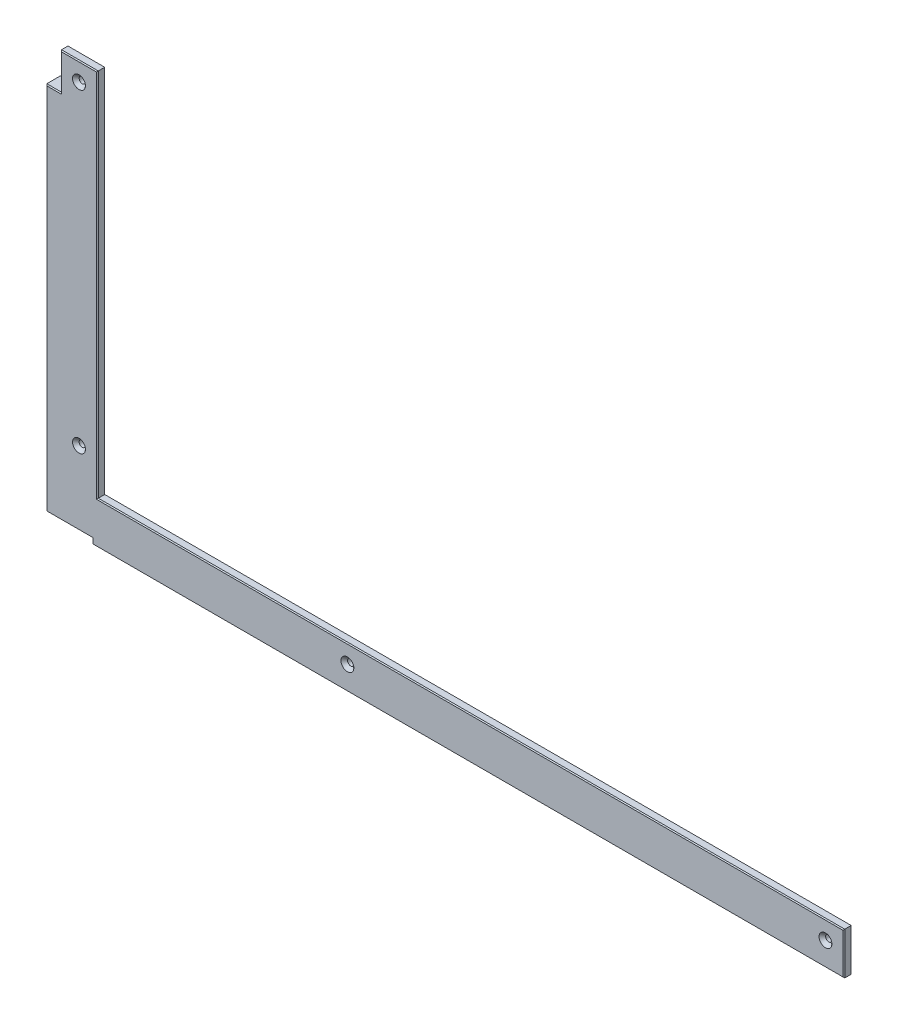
ISO-10303-21;
HEADER;
FILE_DESCRIPTION(('STEP AP214'),'2;1');
FILE_NAME('part.step','',(''),(''),'','','');
FILE_SCHEMA(('AUTOMOTIVE_DESIGN { 1 0 10303 214 1 1 1 1 }'));
ENDSEC;
DATA;
#1=APPLICATION_CONTEXT('core data for automotive mechanical design processes');
#2=APPLICATION_PROTOCOL_DEFINITION('international standard','automotive_design',2000,#1);
#3=PRODUCT_CONTEXT('',#1,'mechanical');
#4=PRODUCT('Part','Part','',(#3));
#5=PRODUCT_RELATED_PRODUCT_CATEGORY('part','',(#4));
#6=PRODUCT_DEFINITION_FORMATION('','',#4);
#7=PRODUCT_DEFINITION_CONTEXT('part definition',#1,'design');
#8=PRODUCT_DEFINITION('design','',#6,#7);
#9=PRODUCT_DEFINITION_SHAPE('','',#8);
#10=(LENGTH_UNIT() NAMED_UNIT(*) SI_UNIT(.MILLI.,.METRE.));
#11=(NAMED_UNIT(*) PLANE_ANGLE_UNIT() SI_UNIT($,.RADIAN.));
#12=(NAMED_UNIT(*) SI_UNIT($,.STERADIAN.) SOLID_ANGLE_UNIT());
#13=UNCERTAINTY_MEASURE_WITH_UNIT(LENGTH_MEASURE(1.E-05),#10,'distance_accuracy_value','');
#14=(GEOMETRIC_REPRESENTATION_CONTEXT(3) GLOBAL_UNCERTAINTY_ASSIGNED_CONTEXT((#13)) GLOBAL_UNIT_ASSIGNED_CONTEXT((#10,
#11,#12)) REPRESENTATION_CONTEXT('',''));
#15=CARTESIAN_POINT('',(0.,0.,0.));
#16=DIRECTION('',(0.,0.,1.));
#17=DIRECTION('',(1.,0.,0.));
#18=AXIS2_PLACEMENT_3D('',#15,#16,#17);
#19=CARTESIAN_POINT('',(-416.,-211.25,8.));
#20=DIRECTION('',(0.,1.,0.));
#21=DIRECTION('',(0.,0.,1.));
#22=AXIS2_PLACEMENT_3D('',#19,#20,#21);
#23=PLANE('',#22);
#24=DIRECTION('',(0.,0.,-1.));
#25=VECTOR('',#24,1.);
#26=CARTESIAN_POINT('',(-399.,-211.25,8.));
#27=LINE('',#26,#25);
#28=CARTESIAN_POINT('',(-399.,-211.25,7.50000000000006));
#29=VERTEX_POINT('',#28);
#30=CARTESIAN_POINT('',(-399.,-211.25,0.));
#31=VERTEX_POINT('',#30);
#32=EDGE_CURVE('E239',#29,#31,#27,.T.);
#33=ORIENTED_EDGE('',*,*,#32,.F.);
#34=DIRECTION('',(-1.,0.,0.));
#35=VECTOR('',#34,1.);
#36=CARTESIAN_POINT('',(-416.,-211.25,7.50000000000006));
#37=LINE('',#36,#35);
#38=CARTESIAN_POINT('',(-424.,-211.25,7.50000000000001));
#39=VERTEX_POINT('',#38);
#40=EDGE_CURVE('E397',#29,#39,#37,.T.);
#41=ORIENTED_EDGE('',*,*,#40,.T.);
#42=DIRECTION('',(0.,0.,1.));
#43=VECTOR('',#42,1.);
#44=CARTESIAN_POINT('',(-424.,-211.25,-201.451141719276));
#45=LINE('',#44,#43);
#46=CARTESIAN_POINT('',(-424.,-211.25,0.));
#47=VERTEX_POINT('',#46);
#48=EDGE_CURVE('E248',#47,#39,#45,.T.);
#49=ORIENTED_EDGE('',*,*,#48,.F.);
#50=DIRECTION('',(1.,0.,0.));
#51=VECTOR('',#50,1.);
#52=CARTESIAN_POINT('',(-416.,-211.25,0.));
#53=LINE('',#52,#51);
#54=EDGE_CURVE('E328',#47,#31,#53,.T.);
#55=ORIENTED_EDGE('',*,*,#54,.T.);
#56=EDGE_LOOP('',(#33,#41,#49,#55));
#57=FACE_BOUND('',#56,.T.);
#58=ADVANCED_FACE('F38',(#57),#23,.F.);
#59=CARTESIAN_POINT('',(0.,0.,8.));
#60=DIRECTION('',(0.,0.,-1.));
#61=DIRECTION('',(-1.,0.,0.));
#62=AXIS2_PLACEMENT_3D('',#59,#60,#61);
#63=PLANE('',#62);
#64=DIRECTION('',(1.,0.,0.));
#65=VECTOR('',#64,1.);
#66=CARTESIAN_POINT('',(0.,-213.75,8.));
#67=LINE('',#66,#65);
#68=CARTESIAN_POINT('',(-398.5,-213.75,8.));
#69=VERTEX_POINT('',#68);
#70=CARTESIAN_POINT('',(9.50000000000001,-213.75,8.));
#71=VERTEX_POINT('',#70);
#72=EDGE_CURVE('E358',#69,#71,#67,.T.);
#73=ORIENTED_EDGE('',*,*,#72,.T.);
#74=DIRECTION('',(0.,1.,0.));
#75=VECTOR('',#74,1.);
#76=CARTESIAN_POINT('',(9.50000000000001,0.,8.));
#77=LINE('',#76,#75);
#78=CARTESIAN_POINT('',(9.50000000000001,-191.75,8.));
#79=VERTEX_POINT('',#78);
#80=EDGE_CURVE('E378',#71,#79,#77,.T.);
#81=ORIENTED_EDGE('',*,*,#80,.T.);
#82=DIRECTION('',(-1.,0.,0.));
#83=VECTOR('',#82,1.);
#84=CARTESIAN_POINT('',(-396.,-191.75,8.));
#85=LINE('',#84,#83);
#86=CARTESIAN_POINT('',(-396.5,-191.75,8.));
#87=VERTEX_POINT('',#86);
#88=EDGE_CURVE('E375',#79,#87,#85,.T.);
#89=ORIENTED_EDGE('',*,*,#88,.T.);
#90=DIRECTION('',(0.,1.,0.));
#91=VECTOR('',#90,1.);
#92=CARTESIAN_POINT('',(-396.5,10.,8.));
#93=LINE('',#92,#91);
#94=CARTESIAN_POINT('',(-396.5,9.50000000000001,8.));
#95=VERTEX_POINT('',#94);
#96=EDGE_CURVE('E373',#87,#95,#93,.T.);
#97=ORIENTED_EDGE('',*,*,#96,.T.);
#98=DIRECTION('',(-1.,0.,0.));
#99=VECTOR('',#98,1.);
#100=CARTESIAN_POINT('',(0.,9.50000000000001,8.));
#101=LINE('',#100,#99);
#102=CARTESIAN_POINT('',(-415.5,9.50000000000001,8.));
#103=VERTEX_POINT('',#102);
#104=EDGE_CURVE('E371',#95,#103,#101,.T.);
#105=ORIENTED_EDGE('',*,*,#104,.T.);
#106=DIRECTION('',(0.,-1.,0.));
#107=VECTOR('',#106,1.);
#108=CARTESIAN_POINT('',(-415.5,0.,8.));
#109=LINE('',#108,#107);
#110=CARTESIAN_POINT('',(-415.5,-10.5,8.));
#111=VERTEX_POINT('',#110);
#112=EDGE_CURVE('E369',#103,#111,#109,.T.);
#113=ORIENTED_EDGE('',*,*,#112,.T.);
#114=DIRECTION('',(-1.,0.,0.));
#115=VECTOR('',#114,1.);
#116=CARTESIAN_POINT('',(0.,-10.5,8.));
#117=LINE('',#116,#115);
#118=CARTESIAN_POINT('',(-423.5,-10.5,8.));
#119=VERTEX_POINT('',#118);
#120=EDGE_CURVE('E367',#111,#119,#117,.T.);
#121=ORIENTED_EDGE('',*,*,#120,.T.);
#122=DIRECTION('',(0.,-1.,0.));
#123=VECTOR('',#122,1.);
#124=CARTESIAN_POINT('',(-423.5,-211.25,8.));
#125=LINE('',#124,#123);
#126=CARTESIAN_POINT('',(-423.5,-210.75,8.));
#127=VERTEX_POINT('',#126);
#128=EDGE_CURVE('E365',#119,#127,#125,.T.);
#129=ORIENTED_EDGE('',*,*,#128,.T.);
#130=DIRECTION('',(1.,0.,0.));
#131=VECTOR('',#130,1.);
#132=CARTESIAN_POINT('',(0.,-210.75,8.));
#133=LINE('',#132,#131);
#134=CARTESIAN_POINT('',(-398.5,-210.75,8.));
#135=VERTEX_POINT('',#134);
#136=EDGE_CURVE('E363',#127,#135,#133,.T.);
#137=ORIENTED_EDGE('',*,*,#136,.T.);
#138=DIRECTION('',(0.,-1.,0.));
#139=VECTOR('',#138,1.);
#140=CARTESIAN_POINT('',(-398.5,0.,8.));
#141=LINE('',#140,#139);
#142=EDGE_CURVE('E361',#135,#69,#141,.T.);
#143=ORIENTED_EDGE('',*,*,#142,.T.);
#144=EDGE_LOOP('',(#73,#81,#89,#97,#105,#113,#121,#129,#137,#143));
#145=FACE_BOUND('',#144,.T.);
#146=CARTESIAN_POINT('',(0.,-201.25,8.));
#147=DIRECTION('',(0.,0.,1.));
#148=DIRECTION('',(1.,0.,0.));
#149=AXIS2_PLACEMENT_3D('',#146,#147,#148);
#150=CIRCLE('',#149,3.5);
#151=CARTESIAN_POINT('',(3.5,-201.25,8.));
#152=VERTEX_POINT('',#151);
#153=EDGE_CURVE('E301',#152,#152,#150,.T.);
#154=ORIENTED_EDGE('',*,*,#153,.F.);
#155=EDGE_LOOP('',(#154));
#156=FACE_BOUND('',#155,.T.);
#157=CARTESIAN_POINT('',(-406.,0.,8.));
#158=DIRECTION('',(0.,0.,1.));
#159=DIRECTION('',(1.,0.,0.));
#160=AXIS2_PLACEMENT_3D('',#157,#158,#159);
#161=CIRCLE('',#160,3.5);
#162=CARTESIAN_POINT('',(-402.5,0.,8.));
#163=VERTEX_POINT('',#162);
#164=EDGE_CURVE('E294',#163,#163,#161,.T.);
#165=ORIENTED_EDGE('',*,*,#164,.F.);
#166=EDGE_LOOP('',(#165));
#167=FACE_BOUND('',#166,.T.);
#168=CARTESIAN_POINT('',(-406.,-171.25,8.));
#169=DIRECTION('',(0.,0.,1.));
#170=DIRECTION('',(1.,0.,0.));
#171=AXIS2_PLACEMENT_3D('',#168,#169,#170);
#172=CIRCLE('',#171,3.5);
#173=CARTESIAN_POINT('',(-402.5,-171.25,8.));
#174=VERTEX_POINT('',#173);
#175=EDGE_CURVE('E287',#174,#174,#172,.T.);
#176=ORIENTED_EDGE('',*,*,#175,.F.);
#177=EDGE_LOOP('',(#176));
#178=FACE_BOUND('',#177,.T.);
#179=CARTESIAN_POINT('',(-260.,-201.25,8.));
#180=DIRECTION('',(0.,0.,1.));
#181=DIRECTION('',(1.,0.,0.));
#182=AXIS2_PLACEMENT_3D('',#179,#180,#181);
#183=CIRCLE('',#182,3.5);
#184=CARTESIAN_POINT('',(-256.5,-201.25,8.));
#185=VERTEX_POINT('',#184);
#186=EDGE_CURVE('E280',#185,#185,#183,.T.);
#187=ORIENTED_EDGE('',*,*,#186,.F.);
#188=EDGE_LOOP('',(#187));
#189=FACE_BOUND('',#188,.T.);
#190=ADVANCED_FACE('F486',(#145,#156,#167,#178,#189),#63,.F.);
#191=CARTESIAN_POINT('',(0.,0.,0.));
#192=DIRECTION('',(0.,0.,-1.));
#193=DIRECTION('',(-1.,0.,0.));
#194=AXIS2_PLACEMENT_3D('',#191,#192,#193);
#195=PLANE('',#194);
#196=DIRECTION('',(0.,1.,0.));
#197=VECTOR('',#196,1.);
#198=CARTESIAN_POINT('',(-10.,-211.25,0.));
#199=LINE('',#198,#197);
#200=CARTESIAN_POINT('',(-10.,-211.25,0.));
#201=VERTEX_POINT('',#200);
#202=CARTESIAN_POINT('',(-9.9999999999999,-203.75,0.));
#203=VERTEX_POINT('',#202);
#204=EDGE_CURVE('E251',#201,#203,#199,.T.);
#205=ORIENTED_EDGE('',*,*,#204,.F.);
#206=DIRECTION('',(-1.,0.,0.));
#207=VECTOR('',#206,1.);
#208=CARTESIAN_POINT('',(-399.,-211.25,0.));
#209=LINE('',#208,#207);
#210=EDGE_CURVE('E414',#201,#31,#209,.T.);
#211=ORIENTED_EDGE('',*,*,#210,.T.);
#212=ORIENTED_EDGE('',*,*,#54,.F.);
#213=DIRECTION('',(0.,-1.,0.));
#214=VECTOR('',#213,1.);
#215=CARTESIAN_POINT('',(-424.,-9.99999999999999,0.));
#216=LINE('',#215,#214);
#217=CARTESIAN_POINT('',(-424.,-9.99999999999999,0.));
#218=VERTEX_POINT('',#217);
#219=EDGE_CURVE('E245',#218,#47,#216,.T.);
#220=ORIENTED_EDGE('',*,*,#219,.F.);
#221=DIRECTION('',(1.,0.,0.));
#222=VECTOR('',#221,1.);
#223=CARTESIAN_POINT('',(-416.,-10.,0.));
#224=LINE('',#223,#222);
#225=CARTESIAN_POINT('',(-408.5,-10.,0.));
#226=VERTEX_POINT('',#225);
#227=EDGE_CURVE('E269',#218,#226,#224,.T.);
#228=ORIENTED_EDGE('',*,*,#227,.T.);
#229=DIRECTION('',(0.,1.,0.));
#230=VECTOR('',#229,1.);
#231=CARTESIAN_POINT('',(-408.5,203.75,0.));
#232=LINE('',#231,#230);
#233=CARTESIAN_POINT('',(-408.5,-203.75,0.));
#234=VERTEX_POINT('',#233);
#235=EDGE_CURVE('E312',#234,#226,#232,.T.);
#236=ORIENTED_EDGE('',*,*,#235,.F.);
#237=DIRECTION('',(-1.,0.,0.));
#238=VECTOR('',#237,1.);
#239=CARTESIAN_POINT('',(408.5,-203.75,0.));
#240=LINE('',#239,#238);
#241=EDGE_CURVE('E316',#203,#234,#240,.T.);
#242=ORIENTED_EDGE('',*,*,#241,.F.);
#243=EDGE_LOOP('',(#205,#211,#212,#220,#228,#236,#242));
#244=FACE_BOUND('',#243,.T.);
#245=ADVANCED_FACE('F458',(#244),#195,.T.);
#246=CARTESIAN_POINT('',(0.,0.,4.));
#247=DIRECTION('',(0.,0.,-1.));
#248=DIRECTION('',(-1.,0.,0.));
#249=AXIS2_PLACEMENT_3D('',#246,#247,#248);
#250=PLANE('',#249);
#251=DIRECTION('',(0.,1.,0.));
#252=VECTOR('',#251,1.);
#253=CARTESIAN_POINT('',(-396.,-191.25,4.));
#254=LINE('',#253,#252);
#255=CARTESIAN_POINT('',(-396.,-191.25,4.));
#256=VERTEX_POINT('',#255);
#257=CARTESIAN_POINT('',(-396.,10.,4.));
#258=VERTEX_POINT('',#257);
#259=EDGE_CURVE('E323',#256,#258,#254,.T.);
#260=ORIENTED_EDGE('',*,*,#259,.F.);
#261=DIRECTION('',(-1.,0.,0.));
#262=VECTOR('',#261,1.);
#263=CARTESIAN_POINT('',(-396.,-191.25,4.));
#264=LINE('',#263,#262);
#265=CARTESIAN_POINT('',(10.,-191.25,4.));
#266=VERTEX_POINT('',#265);
#267=EDGE_CURVE('E331',#266,#256,#264,.T.);
#268=ORIENTED_EDGE('',*,*,#267,.F.);
#269=DIRECTION('',(0.,1.,0.));
#270=VECTOR('',#269,1.);
#271=CARTESIAN_POINT('',(10.,-211.25,4.));
#272=LINE('',#271,#270);
#273=CARTESIAN_POINT('',(10.,-214.25,4.));
#274=VERTEX_POINT('',#273);
#275=EDGE_CURVE('E254',#274,#266,#272,.T.);
#276=ORIENTED_EDGE('',*,*,#275,.F.);
#277=DIRECTION('',(1.,0.,0.));
#278=VECTOR('',#277,1.);
#279=CARTESIAN_POINT('',(-10.,-214.25,4.));
#280=LINE('',#279,#278);
#281=CARTESIAN_POINT('',(-10.,-214.25,4.));
#282=VERTEX_POINT('',#281);
#283=EDGE_CURVE('E238',#282,#274,#280,.T.);
#284=ORIENTED_EDGE('',*,*,#283,.F.);
#285=DIRECTION('',(0.,1.,0.));
#286=VECTOR('',#285,1.);
#287=CARTESIAN_POINT('',(-10.,-211.25,4.));
#288=LINE('',#287,#286);
#289=CARTESIAN_POINT('',(-10.,-203.75,4.));
#290=VERTEX_POINT('',#289);
#291=EDGE_CURVE('E257',#282,#290,#288,.T.);
#292=ORIENTED_EDGE('',*,*,#291,.T.);
#293=DIRECTION('',(-1.,0.,0.));
#294=VECTOR('',#293,1.);
#295=CARTESIAN_POINT('',(408.5,-203.75,4.));
#296=LINE('',#295,#294);
#297=CARTESIAN_POINT('',(-408.5,-203.75,4.));
#298=VERTEX_POINT('',#297);
#299=EDGE_CURVE('E308',#290,#298,#296,.T.);
#300=ORIENTED_EDGE('',*,*,#299,.T.);
#301=DIRECTION('',(0.,1.,0.));
#302=VECTOR('',#301,1.);
#303=CARTESIAN_POINT('',(-408.5,203.75,4.));
#304=LINE('',#303,#302);
#305=CARTESIAN_POINT('',(-408.5,-10.,4.));
#306=VERTEX_POINT('',#305);
#307=EDGE_CURVE('E311',#298,#306,#304,.T.);
#308=ORIENTED_EDGE('',*,*,#307,.T.);
#309=DIRECTION('',(1.,0.,0.));
#310=VECTOR('',#309,1.);
#311=CARTESIAN_POINT('',(-416.,-10.,4.));
#312=LINE('',#311,#310);
#313=CARTESIAN_POINT('',(-416.,-10.,4.));
#314=VERTEX_POINT('',#313);
#315=EDGE_CURVE('E272',#314,#306,#312,.T.);
#316=ORIENTED_EDGE('',*,*,#315,.F.);
#317=DIRECTION('',(0.,-1.,0.));
#318=VECTOR('',#317,1.);
#319=CARTESIAN_POINT('',(-416.,10.,4.));
#320=LINE('',#319,#318);
#321=CARTESIAN_POINT('',(-416.,10.,4.));
#322=VERTEX_POINT('',#321);
#323=EDGE_CURVE('E265',#322,#314,#320,.T.);
#324=ORIENTED_EDGE('',*,*,#323,.F.);
#325=DIRECTION('',(1.,0.,0.));
#326=VECTOR('',#325,1.);
#327=CARTESIAN_POINT('',(-416.,10.,4.));
#328=LINE('',#327,#326);
#329=EDGE_CURVE('E268',#322,#258,#328,.T.);
#330=ORIENTED_EDGE('',*,*,#329,.T.);
#331=EDGE_LOOP('',(#260,#268,#276,#284,#292,#300,#308,#316,#324,#330));
#332=FACE_BOUND('',#331,.T.);
#333=CARTESIAN_POINT('',(-260.,-201.25,4.));
#334=DIRECTION('',(0.,0.,-1.));
#335=DIRECTION('',(-1.,0.,0.));
#336=AXIS2_PLACEMENT_3D('',#333,#334,#335);
#337=CIRCLE('',#336,1.69999999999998);
#338=CARTESIAN_POINT('',(-261.7,-201.25,4.));
#339=VERTEX_POINT('',#338);
#340=EDGE_CURVE('E286',#339,#339,#337,.T.);
#341=ORIENTED_EDGE('',*,*,#340,.F.);
#342=EDGE_LOOP('',(#341));
#343=FACE_BOUND('',#342,.T.);
#344=CARTESIAN_POINT('',(-406.,-171.25,4.));
#345=DIRECTION('',(0.,0.,-1.));
#346=DIRECTION('',(-1.,0.,0.));
#347=AXIS2_PLACEMENT_3D('',#344,#345,#346);
#348=CIRCLE('',#347,1.69999999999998);
#349=CARTESIAN_POINT('',(-407.7,-171.25,4.));
#350=VERTEX_POINT('',#349);
#351=EDGE_CURVE('E293',#350,#350,#348,.T.);
#352=ORIENTED_EDGE('',*,*,#351,.F.);
#353=EDGE_LOOP('',(#352));
#354=FACE_BOUND('',#353,.T.);
#355=CARTESIAN_POINT('',(-406.,0.,4.));
#356=DIRECTION('',(0.,0.,-1.));
#357=DIRECTION('',(-1.,0.,0.));
#358=AXIS2_PLACEMENT_3D('',#355,#356,#357);
#359=CIRCLE('',#358,1.69999999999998);
#360=CARTESIAN_POINT('',(-407.7,0.,4.));
#361=VERTEX_POINT('',#360);
#362=EDGE_CURVE('E300',#361,#361,#359,.T.);
#363=ORIENTED_EDGE('',*,*,#362,.F.);
#364=EDGE_LOOP('',(#363));
#365=FACE_BOUND('',#364,.T.);
#366=CARTESIAN_POINT('',(0.,-201.25,4.));
#367=DIRECTION('',(0.,0.,-1.));
#368=DIRECTION('',(-1.,0.,0.));
#369=AXIS2_PLACEMENT_3D('',#366,#367,#368);
#370=CIRCLE('',#369,1.7);
#371=CARTESIAN_POINT('',(-1.7,-201.25,4.));
#372=VERTEX_POINT('',#371);
#373=EDGE_CURVE('E307',#372,#372,#370,.T.);
#374=ORIENTED_EDGE('',*,*,#373,.F.);
#375=EDGE_LOOP('',(#374));
#376=FACE_BOUND('',#375,.T.);
#377=ADVANCED_FACE('F505',(#332,#343,#354,#365,#376),#250,.T.);
#378=CARTESIAN_POINT('',(-396.,-191.25,8.));
#379=DIRECTION('',(1.,0.,0.));
#380=DIRECTION('',(0.,0.,-1.));
#381=AXIS2_PLACEMENT_3D('',#378,#379,#380);
#382=PLANE('',#381);
#383=DIRECTION('',(0.,0.,-1.));
#384=VECTOR('',#383,1.);
#385=CARTESIAN_POINT('',(-396.,10.,7.99999999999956));
#386=LINE('',#385,#384);
#387=CARTESIAN_POINT('',(-396.,10.,7.50000000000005));
#388=VERTEX_POINT('',#387);
#389=EDGE_CURVE('E271',#388,#258,#386,.T.);
#390=ORIENTED_EDGE('',*,*,#389,.F.);
#391=DIRECTION('',(0.,-1.,0.));
#392=VECTOR('',#391,1.);
#393=CARTESIAN_POINT('',(-396.,-191.25,7.50000000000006));
#394=LINE('',#393,#392);
#395=CARTESIAN_POINT('',(-396.,-191.25,7.50000000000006));
#396=VERTEX_POINT('',#395);
#397=EDGE_CURVE('E387',#388,#396,#394,.T.);
#398=ORIENTED_EDGE('',*,*,#397,.T.);
#399=DIRECTION('',(0.,0.,-1.));
#400=VECTOR('',#399,1.);
#401=CARTESIAN_POINT('',(-396.,-191.25,8.));
#402=LINE('',#401,#400);
#403=EDGE_CURVE('E326',#396,#256,#402,.T.);
#404=ORIENTED_EDGE('',*,*,#403,.T.);
#405=ORIENTED_EDGE('',*,*,#259,.T.);
#406=EDGE_LOOP('',(#390,#398,#404,#405));
#407=FACE_BOUND('',#406,.T.);
#408=ADVANCED_FACE('F689',(#407),#382,.T.);
#409=CARTESIAN_POINT('',(-396.,-191.25,8.));
#410=DIRECTION('',(0.,1.,0.));
#411=DIRECTION('',(0.,0.,1.));
#412=AXIS2_PLACEMENT_3D('',#409,#410,#411);
#413=PLANE('',#412);
#414=ORIENTED_EDGE('',*,*,#403,.F.);
#415=DIRECTION('',(1.,0.,0.));
#416=VECTOR('',#415,1.);
#417=CARTESIAN_POINT('',(10.,-191.25,7.50000000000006));
#418=LINE('',#417,#416);
#419=CARTESIAN_POINT('',(10.,-191.25,7.50000000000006));
#420=VERTEX_POINT('',#419);
#421=EDGE_CURVE('E384',#396,#420,#418,.T.);
#422=ORIENTED_EDGE('',*,*,#421,.T.);
#423=DIRECTION('',(0.,0.,1.));
#424=VECTOR('',#423,1.);
#425=CARTESIAN_POINT('',(10.,-191.25,7.99999999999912));
#426=LINE('',#425,#424);
#427=EDGE_CURVE('E256',#266,#420,#426,.T.);
#428=ORIENTED_EDGE('',*,*,#427,.F.);
#429=ORIENTED_EDGE('',*,*,#267,.T.);
#430=EDGE_LOOP('',(#414,#422,#428,#429));
#431=FACE_BOUND('',#430,.T.);
#432=ADVANCED_FACE('F563',(#431),#413,.T.);
#433=CARTESIAN_POINT('',(-416.,-211.25,8.));
#434=DIRECTION('',(1.,0.,0.));
#435=DIRECTION('',(0.,0.,-1.));
#436=AXIS2_PLACEMENT_3D('',#433,#434,#435);
#437=PLANE('',#436);
#438=DIRECTION('',(0.,0.,1.));
#439=VECTOR('',#438,1.);
#440=CARTESIAN_POINT('',(-416.,-10.,8.));
#441=LINE('',#440,#439);
#442=CARTESIAN_POINT('',(-416.,-10.,7.50000000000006));
#443=VERTEX_POINT('',#442);
#444=EDGE_CURVE('E225',#314,#443,#441,.T.);
#445=ORIENTED_EDGE('',*,*,#444,.T.);
#446=DIRECTION('',(0.,1.,0.));
#447=VECTOR('',#446,1.);
#448=CARTESIAN_POINT('',(-416.,-211.25,7.50000000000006));
#449=LINE('',#448,#447);
#450=CARTESIAN_POINT('',(-416.,10.,7.50000000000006));
#451=VERTEX_POINT('',#450);
#452=EDGE_CURVE('E391',#443,#451,#449,.T.);
#453=ORIENTED_EDGE('',*,*,#452,.T.);
#454=DIRECTION('',(0.,0.,-1.));
#455=VECTOR('',#454,1.);
#456=CARTESIAN_POINT('',(-416.,10.,7.99999999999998));
#457=LINE('',#456,#455);
#458=EDGE_CURVE('E263',#451,#322,#457,.T.);
#459=ORIENTED_EDGE('',*,*,#458,.T.);
#460=ORIENTED_EDGE('',*,*,#323,.T.);
#461=EDGE_LOOP('',(#445,#453,#459,#460));
#462=FACE_BOUND('',#461,.T.);
#463=ADVANCED_FACE('F496',(#462),#437,.F.);
#464=CARTESIAN_POINT('',(-408.5,203.75,4.));
#465=DIRECTION('',(-1.,0.,0.));
#466=DIRECTION('',(0.,-1.,0.));
#467=AXIS2_PLACEMENT_3D('',#464,#465,#466);
#468=PLANE('',#467);
#469=ORIENTED_EDGE('',*,*,#235,.T.);
#470=DIRECTION('',(0.,0.,1.));
#471=VECTOR('',#470,1.);
#472=CARTESIAN_POINT('',(-408.5,-10.,4.00000000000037));
#473=LINE('',#472,#471);
#474=EDGE_CURVE('E277',#226,#306,#473,.T.);
#475=ORIENTED_EDGE('',*,*,#474,.T.);
#476=ORIENTED_EDGE('',*,*,#307,.F.);
#477=DIRECTION('',(0.,0.,-1.));
#478=VECTOR('',#477,1.);
#479=CARTESIAN_POINT('',(-408.5,-203.75,4.));
#480=LINE('',#479,#478);
#481=EDGE_CURVE('E315',#298,#234,#480,.T.);
#482=ORIENTED_EDGE('',*,*,#481,.T.);
#483=EDGE_LOOP('',(#469,#475,#476,#482));
#484=FACE_BOUND('',#483,.T.);
#485=ADVANCED_FACE('F509',(#484),#468,.F.);
#486=CARTESIAN_POINT('',(408.5,-203.75,4.));
#487=DIRECTION('',(0.,-1.,0.));
#488=DIRECTION('',(0.,0.,-1.));
#489=AXIS2_PLACEMENT_3D('',#486,#487,#488);
#490=PLANE('',#489);
#491=ORIENTED_EDGE('',*,*,#299,.F.);
#492=DIRECTION('',(0.,0.,-1.));
#493=VECTOR('',#492,1.);
#494=CARTESIAN_POINT('',(-10.,-203.75,4.00000000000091));
#495=LINE('',#494,#493);
#496=EDGE_CURVE('E335',#290,#203,#495,.T.);
#497=ORIENTED_EDGE('',*,*,#496,.T.);
#498=ORIENTED_EDGE('',*,*,#241,.T.);
#499=ORIENTED_EDGE('',*,*,#481,.F.);
#500=EDGE_LOOP('',(#491,#497,#498,#499));
#501=FACE_BOUND('',#500,.T.);
#502=ADVANCED_FACE('F513',(#501),#490,.F.);
#503=CARTESIAN_POINT('',(0.,-201.25,8.));
#504=DIRECTION('',(0.,0.,1.));
#505=DIRECTION('',(1.,0.,0.));
#506=AXIS2_PLACEMENT_3D('',#503,#504,#505);
#507=CYLINDRICAL_SURFACE('',#506,1.7);
#508=ORIENTED_EDGE('',*,*,#373,.T.);
#509=EDGE_LOOP('',(#508));
#510=FACE_BOUND('',#509,.T.);
#511=CARTESIAN_POINT('',(0.,-201.25,6.2));
#512=DIRECTION('',(0.,0.,1.));
#513=DIRECTION('',(1.,0.,0.));
#514=AXIS2_PLACEMENT_3D('',#511,#512,#513);
#515=CIRCLE('',#514,1.7);
#516=CARTESIAN_POINT('',(1.7,-201.25,6.2));
#517=VERTEX_POINT('',#516);
#518=EDGE_CURVE('E304',#517,#517,#515,.T.);
#519=ORIENTED_EDGE('',*,*,#518,.T.);
#520=EDGE_LOOP('',(#519));
#521=FACE_BOUND('',#520,.T.);
#522=ADVANCED_FACE('F682',(#510,#521),#507,.F.);
#523=CARTESIAN_POINT('',(0.,-201.25,8.));
#524=DIRECTION('',(0.,0.,1.));
#525=DIRECTION('',(1.,0.,0.));
#526=AXIS2_PLACEMENT_3D('',#523,#524,#525);
#527=CONICAL_SURFACE('',#526,3.5,0.785398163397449);
#528=ORIENTED_EDGE('',*,*,#518,.F.);
#529=EDGE_LOOP('',(#528));
#530=FACE_BOUND('',#529,.T.);
#531=ORIENTED_EDGE('',*,*,#153,.T.);
#532=EDGE_LOOP('',(#531));
#533=FACE_BOUND('',#532,.T.);
#534=ADVANCED_FACE('F678',(#530,#533),#527,.F.);
#535=CARTESIAN_POINT('',(-406.,0.,8.));
#536=DIRECTION('',(0.,0.,1.));
#537=DIRECTION('',(1.,0.,0.));
#538=AXIS2_PLACEMENT_3D('',#535,#536,#537);
#539=CYLINDRICAL_SURFACE('',#538,1.69999999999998);
#540=ORIENTED_EDGE('',*,*,#362,.T.);
#541=EDGE_LOOP('',(#540));
#542=FACE_BOUND('',#541,.T.);
#543=CARTESIAN_POINT('',(-406.,0.,6.2));
#544=DIRECTION('',(0.,0.,1.));
#545=DIRECTION('',(1.,0.,0.));
#546=AXIS2_PLACEMENT_3D('',#543,#544,#545);
#547=CIRCLE('',#546,1.69999999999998);
#548=CARTESIAN_POINT('',(-404.3,0.,6.2));
#549=VERTEX_POINT('',#548);
#550=EDGE_CURVE('E297',#549,#549,#547,.T.);
#551=ORIENTED_EDGE('',*,*,#550,.T.);
#552=EDGE_LOOP('',(#551));
#553=FACE_BOUND('',#552,.T.);
#554=ADVANCED_FACE('F674',(#542,#553),#539,.F.);
#555=CARTESIAN_POINT('',(-406.,0.,8.));
#556=DIRECTION('',(0.,0.,1.));
#557=DIRECTION('',(1.,0.,0.));
#558=AXIS2_PLACEMENT_3D('',#555,#556,#557);
#559=CONICAL_SURFACE('',#558,3.5,0.785398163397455);
#560=ORIENTED_EDGE('',*,*,#550,.F.);
#561=EDGE_LOOP('',(#560));
#562=FACE_BOUND('',#561,.T.);
#563=ORIENTED_EDGE('',*,*,#164,.T.);
#564=EDGE_LOOP('',(#563));
#565=FACE_BOUND('',#564,.T.);
#566=ADVANCED_FACE('F670',(#562,#565),#559,.F.);
#567=CARTESIAN_POINT('',(-406.,-171.25,8.));
#568=DIRECTION('',(0.,0.,1.));
#569=DIRECTION('',(1.,0.,0.));
#570=AXIS2_PLACEMENT_3D('',#567,#568,#569);
#571=CYLINDRICAL_SURFACE('',#570,1.69999999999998);
#572=ORIENTED_EDGE('',*,*,#351,.T.);
#573=EDGE_LOOP('',(#572));
#574=FACE_BOUND('',#573,.T.);
#575=CARTESIAN_POINT('',(-406.,-171.25,6.2));
#576=DIRECTION('',(0.,0.,1.));
#577=DIRECTION('',(1.,0.,0.));
#578=AXIS2_PLACEMENT_3D('',#575,#576,#577);
#579=CIRCLE('',#578,1.69999999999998);
#580=CARTESIAN_POINT('',(-404.3,-171.25,6.2));
#581=VERTEX_POINT('',#580);
#582=EDGE_CURVE('E290',#581,#581,#579,.T.);
#583=ORIENTED_EDGE('',*,*,#582,.T.);
#584=EDGE_LOOP('',(#583));
#585=FACE_BOUND('',#584,.T.);
#586=ADVANCED_FACE('F666',(#574,#585),#571,.F.);
#587=CARTESIAN_POINT('',(-406.,-171.25,8.));
#588=DIRECTION('',(0.,0.,1.));
#589=DIRECTION('',(1.,0.,0.));
#590=AXIS2_PLACEMENT_3D('',#587,#588,#589);
#591=CONICAL_SURFACE('',#590,3.5,0.785398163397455);
#592=ORIENTED_EDGE('',*,*,#582,.F.);
#593=EDGE_LOOP('',(#592));
#594=FACE_BOUND('',#593,.T.);
#595=ORIENTED_EDGE('',*,*,#175,.T.);
#596=EDGE_LOOP('',(#595));
#597=FACE_BOUND('',#596,.T.);
#598=ADVANCED_FACE('F662',(#594,#597),#591,.F.);
#599=CARTESIAN_POINT('',(-260.,-201.25,8.));
#600=DIRECTION('',(0.,0.,1.));
#601=DIRECTION('',(1.,0.,0.));
#602=AXIS2_PLACEMENT_3D('',#599,#600,#601);
#603=CYLINDRICAL_SURFACE('',#602,1.69999999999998);
#604=ORIENTED_EDGE('',*,*,#340,.T.);
#605=EDGE_LOOP('',(#604));
#606=FACE_BOUND('',#605,.T.);
#607=CARTESIAN_POINT('',(-260.,-201.25,6.2));
#608=DIRECTION('',(0.,0.,1.));
#609=DIRECTION('',(1.,0.,0.));
#610=AXIS2_PLACEMENT_3D('',#607,#608,#609);
#611=CIRCLE('',#610,1.69999999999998);
#612=CARTESIAN_POINT('',(-258.3,-201.25,6.2));
#613=VERTEX_POINT('',#612);
#614=EDGE_CURVE('E283',#613,#613,#611,.T.);
#615=ORIENTED_EDGE('',*,*,#614,.T.);
#616=EDGE_LOOP('',(#615));
#617=FACE_BOUND('',#616,.T.);
#618=ADVANCED_FACE('F658',(#606,#617),#603,.F.);
#619=CARTESIAN_POINT('',(-260.,-201.25,8.));
#620=DIRECTION('',(0.,0.,1.));
#621=DIRECTION('',(1.,0.,0.));
#622=AXIS2_PLACEMENT_3D('',#619,#620,#621);
#623=CONICAL_SURFACE('',#622,3.5,0.785398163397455);
#624=ORIENTED_EDGE('',*,*,#614,.F.);
#625=EDGE_LOOP('',(#624));
#626=FACE_BOUND('',#625,.T.);
#627=ORIENTED_EDGE('',*,*,#186,.T.);
#628=EDGE_LOOP('',(#627));
#629=FACE_BOUND('',#628,.T.);
#630=ADVANCED_FACE('F653',(#626,#629),#623,.F.);
#631=CARTESIAN_POINT('',(-416.,-10.,4.));
#632=DIRECTION('',(0.,-1.,0.));
#633=DIRECTION('',(0.,0.,-1.));
#634=AXIS2_PLACEMENT_3D('',#631,#632,#633);
#635=PLANE('',#634);
#636=DIRECTION('',(0.,0.,1.));
#637=VECTOR('',#636,1.);
#638=CARTESIAN_POINT('',(-424.,-9.99999999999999,-201.451141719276));
#639=LINE('',#638,#637);
#640=CARTESIAN_POINT('',(-424.,-9.99999999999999,7.50000000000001));
#641=VERTEX_POINT('',#640);
#642=EDGE_CURVE('E213',#218,#641,#639,.T.);
#643=ORIENTED_EDGE('',*,*,#642,.T.);
#644=DIRECTION('',(1.,0.,0.));
#645=VECTOR('',#644,1.);
#646=CARTESIAN_POINT('',(-416.,-9.99999999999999,7.50000000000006));
#647=LINE('',#646,#645);
#648=EDGE_CURVE('E393',#641,#443,#647,.T.);
#649=ORIENTED_EDGE('',*,*,#648,.T.);
#650=ORIENTED_EDGE('',*,*,#444,.F.);
#651=ORIENTED_EDGE('',*,*,#315,.T.);
#652=ORIENTED_EDGE('',*,*,#474,.F.);
#653=ORIENTED_EDGE('',*,*,#227,.F.);
#654=EDGE_LOOP('',(#643,#649,#650,#651,#652,#653));
#655=FACE_BOUND('',#654,.T.);
#656=ADVANCED_FACE('F473',(#655),#635,.F.);
#657=CARTESIAN_POINT('',(-416.,10.,7.99999999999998));
#658=DIRECTION('',(0.,-1.,0.));
#659=DIRECTION('',(0.,0.,-1.));
#660=AXIS2_PLACEMENT_3D('',#657,#658,#659);
#661=PLANE('',#660);
#662=ORIENTED_EDGE('',*,*,#458,.F.);
#663=DIRECTION('',(1.,0.,0.));
#664=VECTOR('',#663,1.);
#665=CARTESIAN_POINT('',(-416.,10.,7.50000000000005));
#666=LINE('',#665,#664);
#667=EDGE_CURVE('E389',#451,#388,#666,.T.);
#668=ORIENTED_EDGE('',*,*,#667,.T.);
#669=ORIENTED_EDGE('',*,*,#389,.T.);
#670=ORIENTED_EDGE('',*,*,#329,.F.);
#671=EDGE_LOOP('',(#662,#668,#669,#670));
#672=FACE_BOUND('',#671,.T.);
#673=ADVANCED_FACE('F499',(#672),#661,.F.);
#674=CARTESIAN_POINT('',(-10.,-211.25,4.));
#675=DIRECTION('',(-1.,0.,0.));
#676=DIRECTION('',(0.,0.,1.));
#677=AXIS2_PLACEMENT_3D('',#674,#675,#676);
#678=PLANE('',#677);
#679=DIRECTION('',(0.,0.,1.));
#680=VECTOR('',#679,1.);
#681=CARTESIAN_POINT('',(-10.,-219.25,2.));
#682=LINE('',#681,#680);
#683=CARTESIAN_POINT('',(-10.,-219.25,-0.500000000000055));
#684=VERTEX_POINT('',#683);
#685=CARTESIAN_POINT('',(-10.,-219.25,1.00000000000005));
#686=VERTEX_POINT('',#685);
#687=EDGE_CURVE('E443',#684,#686,#682,.T.);
#688=ORIENTED_EDGE('',*,*,#687,.F.);
#689=DIRECTION('',(0.,0.707106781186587,-0.707106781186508));
#690=VECTOR('',#689,1.);
#691=CARTESIAN_POINT('',(-10.,-219.25,-0.500000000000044));
#692=LINE('',#691,#690);
#693=CARTESIAN_POINT('',(-10.,-218.75,-1.));
#694=VERTEX_POINT('',#693);
#695=EDGE_CURVE('E409',#684,#694,#692,.T.);
#696=ORIENTED_EDGE('',*,*,#695,.T.);
#697=DIRECTION('',(0.,-1.,0.));
#698=VECTOR('',#697,1.);
#699=CARTESIAN_POINT('',(-10.,-212.75,-1.));
#700=LINE('',#699,#698);
#701=CARTESIAN_POINT('',(-10.,-212.25,-1.));
#702=VERTEX_POINT('',#701);
#703=EDGE_CURVE('E61',#702,#694,#700,.T.);
#704=ORIENTED_EDGE('',*,*,#703,.F.);
#705=DIRECTION('',(0.,-0.707106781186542,-0.707106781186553));
#706=VECTOR('',#705,1.);
#707=CARTESIAN_POINT('',(-10.,-209.25,2.00000000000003));
#708=LINE('',#707,#706);
#709=EDGE_CURVE('E47',#702,#201,#708,.F.);
#710=ORIENTED_EDGE('',*,*,#709,.T.);
#711=ORIENTED_EDGE('',*,*,#204,.T.);
#712=ORIENTED_EDGE('',*,*,#496,.F.);
#713=ORIENTED_EDGE('',*,*,#291,.F.);
#714=DIRECTION('',(0.,0.,1.));
#715=VECTOR('',#714,1.);
#716=CARTESIAN_POINT('',(-10.,-214.25,0.));
#717=LINE('',#716,#715);
#718=CARTESIAN_POINT('',(-10.,-214.25,2.));
#719=VERTEX_POINT('',#718);
#720=EDGE_CURVE('E236',#719,#282,#717,.T.);
#721=ORIENTED_EDGE('',*,*,#720,.F.);
#722=DIRECTION('',(0.,-1.,0.));
#723=VECTOR('',#722,1.);
#724=CARTESIAN_POINT('',(-10.,-212.75,2.));
#725=LINE('',#724,#723);
#726=CARTESIAN_POINT('',(-10.,-218.25,2.));
#727=VERTEX_POINT('',#726);
#728=EDGE_CURVE('E222',#719,#727,#725,.T.);
#729=ORIENTED_EDGE('',*,*,#728,.T.);
#730=DIRECTION('',(0.,-0.707106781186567,-0.707106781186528));
#731=VECTOR('',#730,1.);
#732=CARTESIAN_POINT('',(-10.,-219.25,1.00000000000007));
#733=LINE('',#732,#731);
#734=EDGE_CURVE('E355',#727,#686,#733,.T.);
#735=ORIENTED_EDGE('',*,*,#734,.T.);
#736=EDGE_LOOP('',(#688,#696,#704,#710,#711,#712,#713,#721,#729,#735));
#737=FACE_BOUND('',#736,.T.);
#738=ADVANCED_FACE('F452',(#737),#678,.F.);
#739=CARTESIAN_POINT('',(10.,-211.25,8.00000000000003));
#740=DIRECTION('',(-1.,0.,0.));
#741=DIRECTION('',(0.,0.,1.));
#742=AXIS2_PLACEMENT_3D('',#739,#740,#741);
#743=PLANE('',#742);
#744=ORIENTED_EDGE('',*,*,#427,.T.);
#745=DIRECTION('',(0.,-1.,0.));
#746=VECTOR('',#745,1.);
#747=CARTESIAN_POINT('',(10.,-211.25,7.50000000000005));
#748=LINE('',#747,#746);
#749=CARTESIAN_POINT('',(10.,-214.25,7.50000000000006));
#750=VERTEX_POINT('',#749);
#751=EDGE_CURVE('E381',#420,#750,#748,.T.);
#752=ORIENTED_EDGE('',*,*,#751,.T.);
#753=DIRECTION('',(0.,0.,1.));
#754=VECTOR('',#753,1.);
#755=CARTESIAN_POINT('',(10.,-214.25,4.));
#756=LINE('',#755,#754);
#757=EDGE_CURVE('E214',#274,#750,#756,.T.);
#758=ORIENTED_EDGE('',*,*,#757,.F.);
#759=ORIENTED_EDGE('',*,*,#275,.T.);
#760=EDGE_LOOP('',(#744,#752,#758,#759));
#761=FACE_BOUND('',#760,.T.);
#762=ADVANCED_FACE('F519',(#761),#743,.F.);
#763=CARTESIAN_POINT('',(-424.,-9.99999999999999,-201.451141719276));
#764=DIRECTION('',(-1.,0.,0.));
#765=DIRECTION('',(0.,0.,1.));
#766=AXIS2_PLACEMENT_3D('',#763,#764,#765);
#767=PLANE('',#766);
#768=ORIENTED_EDGE('',*,*,#48,.T.);
#769=DIRECTION('',(0.,1.,0.));
#770=VECTOR('',#769,1.);
#771=CARTESIAN_POINT('',(-424.,-9.99999999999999,7.50000000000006));
#772=LINE('',#771,#770);
#773=EDGE_CURVE('E395',#39,#641,#772,.T.);
#774=ORIENTED_EDGE('',*,*,#773,.T.);
#775=ORIENTED_EDGE('',*,*,#642,.F.);
#776=ORIENTED_EDGE('',*,*,#219,.T.);
#777=EDGE_LOOP('',(#768,#774,#775,#776));
#778=FACE_BOUND('',#777,.T.);
#779=ADVANCED_FACE('F469',(#778),#767,.T.);
#780=CARTESIAN_POINT('',(-399.,-214.25,8.));
#781=DIRECTION('',(1.,0.,0.));
#782=DIRECTION('',(0.,0.,-1.));
#783=AXIS2_PLACEMENT_3D('',#780,#781,#782);
#784=PLANE('',#783);
#785=DIRECTION('',(0.,0.,-1.));
#786=VECTOR('',#785,1.);
#787=CARTESIAN_POINT('',(-399.,-214.25,8.));
#788=LINE('',#787,#786);
#789=CARTESIAN_POINT('',(-399.,-214.25,7.50000000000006));
#790=VERTEX_POINT('',#789);
#791=CARTESIAN_POINT('',(-399.,-214.25,2.));
#792=VERTEX_POINT('',#791);
#793=EDGE_CURVE('E202',#790,#792,#788,.T.);
#794=ORIENTED_EDGE('',*,*,#793,.F.);
#795=DIRECTION('',(0.,1.,0.));
#796=VECTOR('',#795,1.);
#797=CARTESIAN_POINT('',(-399.,-214.25,7.50000000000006));
#798=LINE('',#797,#796);
#799=EDGE_CURVE('E401',#790,#29,#798,.T.);
#800=ORIENTED_EDGE('',*,*,#799,.T.);
#801=ORIENTED_EDGE('',*,*,#32,.T.);
#802=DIRECTION('',(0.,0.707106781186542,0.707106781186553));
#803=VECTOR('',#802,1.);
#804=CARTESIAN_POINT('',(-399.,-208.75,2.50000000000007));
#805=LINE('',#804,#803);
#806=CARTESIAN_POINT('',(-399.,-212.25,-1.));
#807=VERTEX_POINT('',#806);
#808=EDGE_CURVE('E11',#31,#807,#805,.F.);
#809=ORIENTED_EDGE('',*,*,#808,.T.);
#810=DIRECTION('',(0.,-1.,0.));
#811=VECTOR('',#810,1.);
#812=CARTESIAN_POINT('',(-399.,-212.75,-1.));
#813=LINE('',#812,#811);
#814=CARTESIAN_POINT('',(-399.,-218.75,-1.));
#815=VERTEX_POINT('',#814);
#816=EDGE_CURVE('E54',#807,#815,#813,.T.);
#817=ORIENTED_EDGE('',*,*,#816,.T.);
#818=DIRECTION('',(0.,-0.707106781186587,0.707106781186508));
#819=VECTOR('',#818,1.);
#820=CARTESIAN_POINT('',(-399.,-219.25,-0.500000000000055));
#821=LINE('',#820,#819);
#822=CARTESIAN_POINT('',(-399.,-219.25,-0.500000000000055));
#823=VERTEX_POINT('',#822);
#824=EDGE_CURVE('E399',#815,#823,#821,.T.);
#825=ORIENTED_EDGE('',*,*,#824,.T.);
#826=DIRECTION('',(0.,0.,-1.));
#827=VECTOR('',#826,1.);
#828=CARTESIAN_POINT('',(-399.,-219.25,2.));
#829=LINE('',#828,#827);
#830=CARTESIAN_POINT('',(-399.,-219.25,1.00000000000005));
#831=VERTEX_POINT('',#830);
#832=EDGE_CURVE('E232',#831,#823,#829,.T.);
#833=ORIENTED_EDGE('',*,*,#832,.F.);
#834=DIRECTION('',(0.,0.707106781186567,0.707106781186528));
#835=VECTOR('',#834,1.);
#836=CARTESIAN_POINT('',(-399.,-219.25,1.00000000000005));
#837=LINE('',#836,#835);
#838=CARTESIAN_POINT('',(-399.,-218.25,2.));
#839=VERTEX_POINT('',#838);
#840=EDGE_CURVE('E229',#831,#839,#837,.T.);
#841=ORIENTED_EDGE('',*,*,#840,.T.);
#842=DIRECTION('',(0.,-1.,0.));
#843=VECTOR('',#842,1.);
#844=CARTESIAN_POINT('',(-399.,-212.75,2.));
#845=LINE('',#844,#843);
#846=EDGE_CURVE('E219',#792,#839,#845,.T.);
#847=ORIENTED_EDGE('',*,*,#846,.F.);
#848=EDGE_LOOP('',(#794,#800,#801,#809,#817,#825,#833,#841,#847));
#849=FACE_BOUND('',#848,.T.);
#850=ADVANCED_FACE('F227',(#849),#784,.F.);
#851=CARTESIAN_POINT('',(0.,-214.25,0.));
#852=DIRECTION('',(0.,1.,0.));
#853=DIRECTION('',(0.,0.,1.));
#854=AXIS2_PLACEMENT_3D('',#851,#852,#853);
#855=PLANE('',#854);
#856=ORIENTED_EDGE('',*,*,#757,.T.);
#857=DIRECTION('',(-1.,0.,0.));
#858=VECTOR('',#857,1.);
#859=CARTESIAN_POINT('',(0.,-214.25,7.50000000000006));
#860=LINE('',#859,#858);
#861=EDGE_CURVE('E209',#750,#790,#860,.T.);
#862=ORIENTED_EDGE('',*,*,#861,.T.);
#863=ORIENTED_EDGE('',*,*,#793,.T.);
#864=DIRECTION('',(1.,0.,0.));
#865=VECTOR('',#864,1.);
#866=CARTESIAN_POINT('',(0.,-214.25,2.));
#867=LINE('',#866,#865);
#868=EDGE_CURVE('E206',#792,#719,#867,.T.);
#869=ORIENTED_EDGE('',*,*,#868,.T.);
#870=ORIENTED_EDGE('',*,*,#720,.T.);
#871=ORIENTED_EDGE('',*,*,#283,.T.);
#872=EDGE_LOOP('',(#856,#862,#863,#869,#870,#871));
#873=FACE_BOUND('',#872,.T.);
#874=ADVANCED_FACE('F205',(#873),#855,.F.);
#875=CARTESIAN_POINT('',(-10.,-212.75,2.));
#876=DIRECTION('',(0.,0.,1.));
#877=DIRECTION('',(1.,0.,0.));
#878=AXIS2_PLACEMENT_3D('',#875,#876,#877);
#879=PLANE('',#878);
#880=ORIENTED_EDGE('',*,*,#846,.T.);
#881=DIRECTION('',(1.,0.,0.));
#882=VECTOR('',#881,1.);
#883=CARTESIAN_POINT('',(-10.,-218.25,2.));
#884=LINE('',#883,#882);
#885=EDGE_CURVE('E352',#839,#727,#884,.T.);
#886=ORIENTED_EDGE('',*,*,#885,.T.);
#887=ORIENTED_EDGE('',*,*,#728,.F.);
#888=ORIENTED_EDGE('',*,*,#868,.F.);
#889=EDGE_LOOP('',(#880,#886,#887,#888));
#890=FACE_BOUND('',#889,.T.);
#891=ADVANCED_FACE('F218',(#890),#879,.T.);
#892=CARTESIAN_POINT('',(-10.,-212.75,-1.));
#893=DIRECTION('',(0.,0.,-1.));
#894=DIRECTION('',(-1.,0.,0.));
#895=AXIS2_PLACEMENT_3D('',#892,#893,#894);
#896=PLANE('',#895);
#897=ORIENTED_EDGE('',*,*,#703,.T.);
#898=DIRECTION('',(-1.,0.,0.));
#899=VECTOR('',#898,1.);
#900=CARTESIAN_POINT('',(-399.,-218.75,-1.));
#901=LINE('',#900,#899);
#902=EDGE_CURVE('E411',#694,#815,#901,.T.);
#903=ORIENTED_EDGE('',*,*,#902,.T.);
#904=ORIENTED_EDGE('',*,*,#816,.F.);
#905=DIRECTION('',(-1.,0.,0.));
#906=VECTOR('',#905,1.);
#907=CARTESIAN_POINT('',(0.,-212.25,-1.));
#908=LINE('',#907,#906);
#909=EDGE_CURVE('E447',#807,#702,#908,.F.);
#910=ORIENTED_EDGE('',*,*,#909,.T.);
#911=EDGE_LOOP('',(#897,#903,#904,#910));
#912=FACE_BOUND('',#911,.T.);
#913=ADVANCED_FACE('F631',(#912),#896,.T.);
#914=CARTESIAN_POINT('',(0.,-219.25,0.));
#915=DIRECTION('',(0.,1.,0.));
#916=DIRECTION('',(0.,0.,1.));
#917=AXIS2_PLACEMENT_3D('',#914,#915,#916);
#918=PLANE('',#917);
#919=ORIENTED_EDGE('',*,*,#832,.T.);
#920=DIRECTION('',(1.,0.,0.));
#921=VECTOR('',#920,1.);
#922=CARTESIAN_POINT('',(-10.,-219.25,-0.500000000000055));
#923=LINE('',#922,#921);
#924=EDGE_CURVE('E405',#823,#684,#923,.T.);
#925=ORIENTED_EDGE('',*,*,#924,.T.);
#926=ORIENTED_EDGE('',*,*,#687,.T.);
#927=DIRECTION('',(-1.,0.,0.));
#928=VECTOR('',#927,1.);
#929=CARTESIAN_POINT('',(-399.,-219.25,1.00000000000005));
#930=LINE('',#929,#928);
#931=EDGE_CURVE('E224',#686,#831,#930,.T.);
#932=ORIENTED_EDGE('',*,*,#931,.T.);
#933=EDGE_LOOP('',(#919,#925,#926,#932));
#934=FACE_BOUND('',#933,.T.);
#935=ADVANCED_FACE('F571',(#934),#918,.F.);
#936=CARTESIAN_POINT('',(0.,-219.25,1.00000000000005));
#937=DIRECTION('',(0.,-0.707106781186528,0.707106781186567));
#938=DIRECTION('',(1.,0.,0.));
#939=AXIS2_PLACEMENT_3D('',#936,#937,#938);
#940=PLANE('',#939);
#941=ORIENTED_EDGE('',*,*,#734,.F.);
#942=ORIENTED_EDGE('',*,*,#885,.F.);
#943=ORIENTED_EDGE('',*,*,#840,.F.);
#944=ORIENTED_EDGE('',*,*,#931,.F.);
#945=EDGE_LOOP('',(#941,#942,#943,#944));
#946=FACE_BOUND('',#945,.T.);
#947=ADVANCED_FACE('F565',(#946),#940,.T.);
#948=CARTESIAN_POINT('',(0.,-10.5,8.));
#949=DIRECTION('',(0.,-0.707106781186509,-0.707106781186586));
#950=DIRECTION('',(-1.,0.,0.));
#951=AXIS2_PLACEMENT_3D('',#948,#949,#950);
#952=PLANE('',#951);
#953=DIRECTION('',(-0.577350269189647,0.577350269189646,-0.577350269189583));
#954=VECTOR('',#953,1.);
#955=CARTESIAN_POINT('',(-419.,-6.99999999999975,4.50000000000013));
#956=LINE('',#955,#954);
#957=EDGE_CURVE('E437',#443,#111,#956,.F.);
#958=ORIENTED_EDGE('',*,*,#957,.F.);
#959=ORIENTED_EDGE('',*,*,#648,.F.);
#960=DIRECTION('',(0.577350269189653,-0.577350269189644,0.577350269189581));
#961=VECTOR('',#960,1.);
#962=CARTESIAN_POINT('',(-427.,-6.99999999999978,4.50000000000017));
#963=LINE('',#962,#961);
#964=EDGE_CURVE('E440',#119,#641,#963,.F.);
#965=ORIENTED_EDGE('',*,*,#964,.F.);
#966=ORIENTED_EDGE('',*,*,#120,.F.);
#967=EDGE_LOOP('',(#958,#959,#965,#966));
#968=FACE_BOUND('',#967,.T.);
#969=ADVANCED_FACE('F477',(#968),#952,.F.);
#970=CARTESIAN_POINT('',(-423.5,0.,8.));
#971=DIRECTION('',(-0.707106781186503,0.,0.707106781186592));
#972=DIRECTION('',(0.,1.,0.));
#973=AXIS2_PLACEMENT_3D('',#970,#971,#972);
#974=PLANE('',#973);
#975=ORIENTED_EDGE('',*,*,#964,.T.);
#976=ORIENTED_EDGE('',*,*,#773,.F.);
#977=DIRECTION('',(0.577350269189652,0.577350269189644,0.57735026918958));
#978=VECTOR('',#977,1.);
#979=CARTESIAN_POINT('',(-282.33333333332,-69.5833333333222,149.166666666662));
#980=LINE('',#979,#978);
#981=EDGE_CURVE('E434',#127,#39,#980,.F.);
#982=ORIENTED_EDGE('',*,*,#981,.F.);
#983=ORIENTED_EDGE('',*,*,#128,.F.);
#984=EDGE_LOOP('',(#975,#976,#982,#983));
#985=FACE_BOUND('',#984,.T.);
#986=ADVANCED_FACE('F482',(#985),#974,.T.);
#987=CARTESIAN_POINT('',(-415.5,0.,8.));
#988=DIRECTION('',(0.707106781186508,0.,-0.707106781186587));
#989=DIRECTION('',(0.,-1.,0.));
#990=AXIS2_PLACEMENT_3D('',#987,#988,#989);
#991=PLANE('',#990);
#992=ORIENTED_EDGE('',*,*,#957,.T.);
#993=ORIENTED_EDGE('',*,*,#112,.F.);
#994=DIRECTION('',(-0.577350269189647,0.577350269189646,-0.577350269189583));
#995=VECTOR('',#994,1.);
#996=CARTESIAN_POINT('',(-412.333333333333,6.33333333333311,11.1666666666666));
#997=LINE('',#996,#995);
#998=EDGE_CURVE('E431',#451,#103,#997,.F.);
#999=ORIENTED_EDGE('',*,*,#998,.F.);
#1000=ORIENTED_EDGE('',*,*,#452,.F.);
#1001=EDGE_LOOP('',(#992,#993,#999,#1000));
#1002=FACE_BOUND('',#1001,.T.);
#1003=ADVANCED_FACE('F491',(#1002),#991,.F.);
#1004=CARTESIAN_POINT('',(0.,-210.75,8.));
#1005=DIRECTION('',(0.,0.707106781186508,-0.707106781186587));
#1006=DIRECTION('',(1.,0.,0.));
#1007=AXIS2_PLACEMENT_3D('',#1004,#1005,#1006);
#1008=PLANE('',#1007);
#1009=ORIENTED_EDGE('',*,*,#981,.T.);
#1010=ORIENTED_EDGE('',*,*,#40,.F.);
#1011=DIRECTION('',(-0.577350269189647,-0.577350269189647,-0.577350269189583));
#1012=VECTOR('',#1011,1.);
#1013=CARTESIAN_POINT('',(-265.666666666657,-77.9166666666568,140.833333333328));
#1014=LINE('',#1013,#1012);
#1015=EDGE_CURVE('E428',#135,#29,#1014,.T.);
#1016=ORIENTED_EDGE('',*,*,#1015,.F.);
#1017=ORIENTED_EDGE('',*,*,#136,.F.);
#1018=EDGE_LOOP('',(#1009,#1010,#1016,#1017));
#1019=FACE_BOUND('',#1018,.T.);
#1020=ADVANCED_FACE('F541',(#1019),#1008,.F.);
#1021=CARTESIAN_POINT('',(-416.,10.,7.50000000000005));
#1022=DIRECTION('',(0.,-0.707106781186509,-0.707106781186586));
#1023=DIRECTION('',(1.,0.,0.));
#1024=AXIS2_PLACEMENT_3D('',#1021,#1022,#1023);
#1025=PLANE('',#1024);
#1026=ORIENTED_EDGE('',*,*,#998,.T.);
#1027=ORIENTED_EDGE('',*,*,#104,.F.);
#1028=DIRECTION('',(-0.577350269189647,-0.577350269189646,0.577350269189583));
#1029=VECTOR('',#1028,1.);
#1030=CARTESIAN_POINT('',(-402.666666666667,3.33333333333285,14.1666666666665));
#1031=LINE('',#1030,#1029);
#1032=EDGE_CURVE('E425',#388,#95,#1031,.T.);
#1033=ORIENTED_EDGE('',*,*,#1032,.F.);
#1034=ORIENTED_EDGE('',*,*,#667,.F.);
#1035=EDGE_LOOP('',(#1026,#1027,#1033,#1034));
#1036=FACE_BOUND('',#1035,.T.);
#1037=ADVANCED_FACE('F543',(#1036),#1025,.F.);
#1038=CARTESIAN_POINT('',(-399.,-214.25,7.50000000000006));
#1039=DIRECTION('',(0.707106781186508,0.,-0.707106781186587));
#1040=DIRECTION('',(0.,1.,0.));
#1041=AXIS2_PLACEMENT_3D('',#1038,#1039,#1040);
#1042=PLANE('',#1041);
#1043=ORIENTED_EDGE('',*,*,#1015,.T.);
#1044=ORIENTED_EDGE('',*,*,#799,.F.);
#1045=DIRECTION('',(-0.577350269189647,-0.577350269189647,-0.577350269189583));
#1046=VECTOR('',#1045,1.);
#1047=CARTESIAN_POINT('',(-265.99999999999,-81.2499999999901,140.499999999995));
#1048=LINE('',#1047,#1046);
#1049=EDGE_CURVE('E422',#69,#790,#1048,.T.);
#1050=ORIENTED_EDGE('',*,*,#1049,.F.);
#1051=ORIENTED_EDGE('',*,*,#142,.F.);
#1052=EDGE_LOOP('',(#1043,#1044,#1050,#1051));
#1053=FACE_BOUND('',#1052,.T.);
#1054=ADVANCED_FACE('F539',(#1053),#1042,.F.);
#1055=CARTESIAN_POINT('',(-396.,-191.25,7.50000000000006));
#1056=DIRECTION('',(0.707106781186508,0.,0.707106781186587));
#1057=DIRECTION('',(0.,1.,0.));
#1058=AXIS2_PLACEMENT_3D('',#1055,#1056,#1057);
#1059=PLANE('',#1058);
#1060=ORIENTED_EDGE('',*,*,#1032,.T.);
#1061=ORIENTED_EDGE('',*,*,#96,.F.);
#1062=DIRECTION('',(0.577350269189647,0.577350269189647,-0.577350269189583));
#1063=VECTOR('',#1062,1.);
#1064=CARTESIAN_POINT('',(-396.,-191.25,7.50000000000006));
#1065=LINE('',#1064,#1063);
#1066=EDGE_CURVE('E419',#396,#87,#1065,.F.);
#1067=ORIENTED_EDGE('',*,*,#1066,.F.);
#1068=ORIENTED_EDGE('',*,*,#397,.F.);
#1069=EDGE_LOOP('',(#1060,#1061,#1067,#1068));
#1070=FACE_BOUND('',#1069,.T.);
#1071=ADVANCED_FACE('F591',(#1070),#1059,.T.);
#1072=CARTESIAN_POINT('',(0.,-214.25,7.50000000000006));
#1073=DIRECTION('',(0.,0.707106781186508,-0.707106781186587));
#1074=DIRECTION('',(-1.,0.,0.));
#1075=AXIS2_PLACEMENT_3D('',#1072,#1073,#1074);
#1076=PLANE('',#1075);
#1077=ORIENTED_EDGE('',*,*,#1049,.T.);
#1078=ORIENTED_EDGE('',*,*,#861,.F.);
#1079=DIRECTION('',(-0.577350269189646,0.577350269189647,0.577350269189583));
#1080=VECTOR('',#1079,1.);
#1081=CARTESIAN_POINT('',(6.66666666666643,-210.916666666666,10.8333333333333));
#1082=LINE('',#1081,#1080);
#1083=EDGE_CURVE('E417',#71,#750,#1082,.F.);
#1084=ORIENTED_EDGE('',*,*,#1083,.F.);
#1085=ORIENTED_EDGE('',*,*,#72,.F.);
#1086=EDGE_LOOP('',(#1077,#1078,#1084,#1085));
#1087=FACE_BOUND('',#1086,.T.);
#1088=ADVANCED_FACE('F537',(#1087),#1076,.F.);
#1089=CARTESIAN_POINT('',(-396.,-191.25,7.50000000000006));
#1090=DIRECTION('',(0.,0.707106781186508,0.707106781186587));
#1091=DIRECTION('',(-1.,0.,0.));
#1092=AXIS2_PLACEMENT_3D('',#1089,#1090,#1091);
#1093=PLANE('',#1092);
#1094=ORIENTED_EDGE('',*,*,#1066,.T.);
#1095=ORIENTED_EDGE('',*,*,#88,.F.);
#1096=DIRECTION('',(-0.577350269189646,-0.577350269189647,0.577350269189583));
#1097=VECTOR('',#1096,1.);
#1098=CARTESIAN_POINT('',(-125.333333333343,-326.583333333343,142.833333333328));
#1099=LINE('',#1098,#1097);
#1100=EDGE_CURVE('E415',#420,#79,#1099,.T.);
#1101=ORIENTED_EDGE('',*,*,#1100,.F.);
#1102=ORIENTED_EDGE('',*,*,#421,.F.);
#1103=EDGE_LOOP('',(#1094,#1095,#1101,#1102));
#1104=FACE_BOUND('',#1103,.T.);
#1105=ADVANCED_FACE('F530',(#1104),#1093,.T.);
#1106=CARTESIAN_POINT('',(9.50000000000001,0.,8.));
#1107=DIRECTION('',(-0.707106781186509,0.,-0.707106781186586));
#1108=DIRECTION('',(0.,1.,0.));
#1109=AXIS2_PLACEMENT_3D('',#1106,#1107,#1108);
#1110=PLANE('',#1109);
#1111=ORIENTED_EDGE('',*,*,#1083,.T.);
#1112=ORIENTED_EDGE('',*,*,#751,.F.);
#1113=ORIENTED_EDGE('',*,*,#1100,.T.);
#1114=ORIENTED_EDGE('',*,*,#80,.F.);
#1115=EDGE_LOOP('',(#1111,#1112,#1113,#1114));
#1116=FACE_BOUND('',#1115,.T.);
#1117=ADVANCED_FACE('F524',(#1116),#1110,.F.);
#1118=CARTESIAN_POINT('',(0.,-219.25,-0.500000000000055));
#1119=DIRECTION('',(0.,-0.707106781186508,-0.707106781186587));
#1120=DIRECTION('',(-1.,0.,0.));
#1121=AXIS2_PLACEMENT_3D('',#1118,#1119,#1120);
#1122=PLANE('',#1121);
#1123=ORIENTED_EDGE('',*,*,#824,.F.);
#1124=ORIENTED_EDGE('',*,*,#902,.F.);
#1125=ORIENTED_EDGE('',*,*,#695,.F.);
#1126=ORIENTED_EDGE('',*,*,#924,.F.);
#1127=EDGE_LOOP('',(#1123,#1124,#1125,#1126));
#1128=FACE_BOUND('',#1127,.T.);
#1129=ADVANCED_FACE('F580',(#1128),#1122,.T.);
#1130=CARTESIAN_POINT('',(0.,-212.75,-1.50000000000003));
#1131=DIRECTION('',(0.,0.707106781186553,-0.707106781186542));
#1132=DIRECTION('',(-1.,0.,0.));
#1133=AXIS2_PLACEMENT_3D('',#1130,#1131,#1132);
#1134=PLANE('',#1133);
#1135=ORIENTED_EDGE('',*,*,#808,.F.);
#1136=ORIENTED_EDGE('',*,*,#210,.F.);
#1137=ORIENTED_EDGE('',*,*,#709,.F.);
#1138=ORIENTED_EDGE('',*,*,#909,.F.);
#1139=EDGE_LOOP('',(#1135,#1136,#1137,#1138));
#1140=FACE_BOUND('',#1139,.T.);
#1141=ADVANCED_FACE('F41',(#1140),#1134,.T.);
#1142=CLOSED_SHELL('',(#58,#190,#245,#377,#408,#432,#463,#485,#502,#522,#534,#554,#566,#586,
#598,#618,#630,#656,#673,#738,#762,#779,#850,#874,#891,#913,#935,#947,#969,#986,#1003,#1020,
#1037,#1054,#1071,#1088,#1105,#1117,#1129,#1141));
#1143=MANIFOLD_SOLID_BREP('B2',#1142);
#1144=ADVANCED_BREP_SHAPE_REPRESENTATION('',(#18,#1143),#14);
#1145=SHAPE_DEFINITION_REPRESENTATION(#9,#1144);
ENDSEC;
END-ISO-10303-21;
